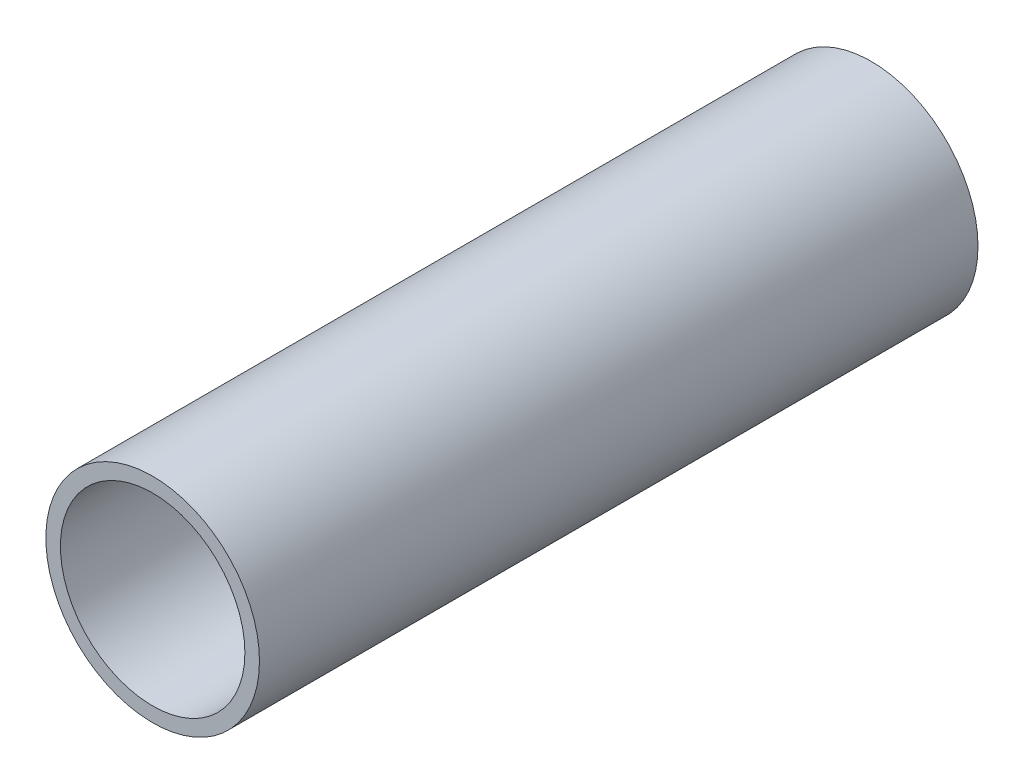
ISO-10303-21;
HEADER;
FILE_DESCRIPTION(('STEP AP214'),'2;1');
FILE_NAME('part.step','',(''),(''),'','','');
FILE_SCHEMA(('AUTOMOTIVE_DESIGN { 1 0 10303 214 1 1 1 1 }'));
ENDSEC;
DATA;
#1=APPLICATION_CONTEXT('core data for automotive mechanical design processes');
#2=APPLICATION_PROTOCOL_DEFINITION('international standard','automotive_design',2000,#1);
#3=PRODUCT_CONTEXT('',#1,'mechanical');
#4=PRODUCT('Part','Part','',(#3));
#5=PRODUCT_RELATED_PRODUCT_CATEGORY('part','',(#4));
#6=PRODUCT_DEFINITION_FORMATION('','',#4);
#7=PRODUCT_DEFINITION_CONTEXT('part definition',#1,'design');
#8=PRODUCT_DEFINITION('design','',#6,#7);
#9=PRODUCT_DEFINITION_SHAPE('','',#8);
#10=(LENGTH_UNIT() NAMED_UNIT(*) SI_UNIT(.MILLI.,.METRE.));
#11=(NAMED_UNIT(*) PLANE_ANGLE_UNIT() SI_UNIT($,.RADIAN.));
#12=(NAMED_UNIT(*) SI_UNIT($,.STERADIAN.) SOLID_ANGLE_UNIT());
#13=UNCERTAINTY_MEASURE_WITH_UNIT(LENGTH_MEASURE(1.E-05),#10,'distance_accuracy_value','');
#14=(GEOMETRIC_REPRESENTATION_CONTEXT(3) GLOBAL_UNCERTAINTY_ASSIGNED_CONTEXT((#13)) GLOBAL_UNIT_ASSIGNED_CONTEXT((#10,
#11,#12)) REPRESENTATION_CONTEXT('',''));
#15=CARTESIAN_POINT('',(0.,0.,0.));
#16=DIRECTION('',(0.,0.,1.));
#17=DIRECTION('',(1.,0.,0.));
#18=AXIS2_PLACEMENT_3D('',#15,#16,#17);
#19=CARTESIAN_POINT('',(0.,0.,37.));
#20=DIRECTION('',(0.,0.,-1.));
#21=DIRECTION('',(-1.,0.,0.));
#22=AXIS2_PLACEMENT_3D('',#19,#20,#21);
#23=CYLINDRICAL_SURFACE('',#22,5.5);
#24=CARTESIAN_POINT('',(0.,0.,37.));
#25=DIRECTION('',(0.,0.,1.));
#26=DIRECTION('',(1.,0.,0.));
#27=AXIS2_PLACEMENT_3D('',#24,#25,#26);
#28=CIRCLE('',#27,5.5);
#29=CARTESIAN_POINT('',(5.5,0.,37.));
#30=VERTEX_POINT('',#29);
#31=EDGE_CURVE('E10',#30,#30,#28,.T.);
#32=ORIENTED_EDGE('',*,*,#31,.F.);
#33=EDGE_LOOP('',(#32));
#34=FACE_BOUND('',#33,.T.);
#35=CARTESIAN_POINT('',(0.,0.,0.));
#36=DIRECTION('',(0.,0.,1.));
#37=DIRECTION('',(1.,0.,0.));
#38=AXIS2_PLACEMENT_3D('',#35,#36,#37);
#39=CIRCLE('',#38,5.5);
#40=CARTESIAN_POINT('',(5.5,0.,0.));
#41=VERTEX_POINT('',#40);
#42=EDGE_CURVE('E38',#41,#41,#39,.T.);
#43=ORIENTED_EDGE('',*,*,#42,.T.);
#44=EDGE_LOOP('',(#43));
#45=FACE_BOUND('',#44,.T.);
#46=ADVANCED_FACE('F35',(#34,#45),#23,.T.);
#47=CARTESIAN_POINT('',(0.,0.,37.));
#48=DIRECTION('',(0.,0.,1.));
#49=DIRECTION('',(1.,0.,0.));
#50=AXIS2_PLACEMENT_3D('',#47,#48,#49);
#51=PLANE('',#50);
#52=CARTESIAN_POINT('',(0.,0.,37.));
#53=DIRECTION('',(0.,0.,1.));
#54=DIRECTION('',(1.,0.,0.));
#55=AXIS2_PLACEMENT_3D('',#52,#53,#54);
#56=CIRCLE('',#55,4.75);
#57=CARTESIAN_POINT('',(4.75,0.,37.));
#58=VERTEX_POINT('',#57);
#59=EDGE_CURVE('E47',#58,#58,#56,.T.);
#60=ORIENTED_EDGE('',*,*,#59,.F.);
#61=EDGE_LOOP('',(#60));
#62=FACE_BOUND('',#61,.T.);
#63=ORIENTED_EDGE('',*,*,#31,.T.);
#64=EDGE_LOOP('',(#63));
#65=FACE_BOUND('',#64,.T.);
#66=ADVANCED_FACE('F62',(#62,#65),#51,.T.);
#67=CARTESIAN_POINT('',(0.,0.,0.));
#68=DIRECTION('',(0.,0.,1.));
#69=DIRECTION('',(1.,0.,0.));
#70=AXIS2_PLACEMENT_3D('',#67,#68,#69);
#71=PLANE('',#70);
#72=CARTESIAN_POINT('',(0.,0.,0.));
#73=DIRECTION('',(0.,0.,1.));
#74=DIRECTION('',(1.,0.,0.));
#75=AXIS2_PLACEMENT_3D('',#72,#73,#74);
#76=CIRCLE('',#75,4.75);
#77=CARTESIAN_POINT('',(4.75,0.,0.));
#78=VERTEX_POINT('',#77);
#79=EDGE_CURVE('E45',#78,#78,#76,.T.);
#80=ORIENTED_EDGE('',*,*,#79,.T.);
#81=EDGE_LOOP('',(#80));
#82=FACE_BOUND('',#81,.T.);
#83=ORIENTED_EDGE('',*,*,#42,.F.);
#84=EDGE_LOOP('',(#83));
#85=FACE_BOUND('',#84,.T.);
#86=ADVANCED_FACE('F53',(#82,#85),#71,.F.);
#87=CARTESIAN_POINT('',(0.,0.,0.));
#88=DIRECTION('',(0.,0.,1.));
#89=DIRECTION('',(1.,0.,0.));
#90=AXIS2_PLACEMENT_3D('',#87,#88,#89);
#91=CYLINDRICAL_SURFACE('',#90,4.75);
#92=ORIENTED_EDGE('',*,*,#79,.F.);
#93=EDGE_LOOP('',(#92));
#94=FACE_BOUND('',#93,.T.);
#95=ORIENTED_EDGE('',*,*,#59,.T.);
#96=EDGE_LOOP('',(#95));
#97=FACE_BOUND('',#96,.T.);
#98=ADVANCED_FACE('F56',(#94,#97),#91,.F.);
#99=CLOSED_SHELL('',(#46,#66,#86,#98));
#100=MANIFOLD_SOLID_BREP('B2',#99);
#101=ADVANCED_BREP_SHAPE_REPRESENTATION('',(#18,#100),#14);
#102=SHAPE_DEFINITION_REPRESENTATION(#9,#101);
ENDSEC;
END-ISO-10303-21;
